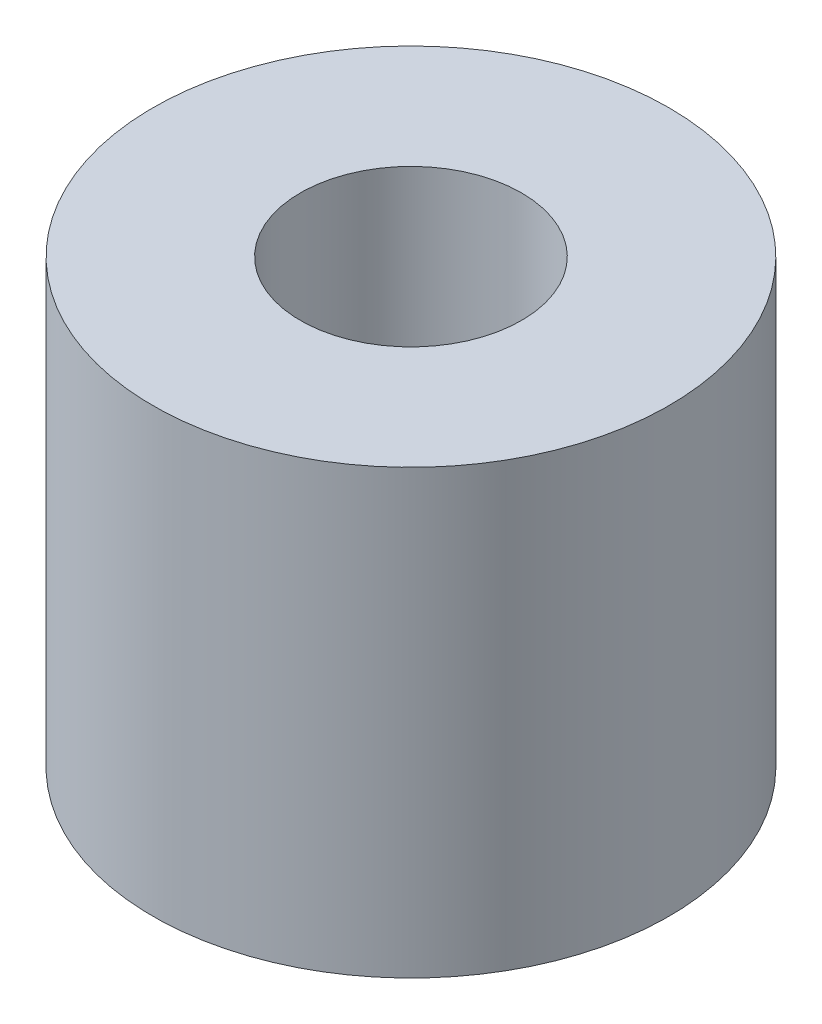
ISO-10303-21;
HEADER;
FILE_DESCRIPTION(('STEP AP214'),'2;1');
FILE_NAME('part.step','',(''),(''),'','','');
FILE_SCHEMA(('AUTOMOTIVE_DESIGN { 1 0 10303 214 1 1 1 1 }'));
ENDSEC;
DATA;
#1=APPLICATION_CONTEXT('core data for automotive mechanical design processes');
#2=APPLICATION_PROTOCOL_DEFINITION('international standard','automotive_design',2000,#1);
#3=PRODUCT_CONTEXT('',#1,'mechanical');
#4=PRODUCT('Part','Part','',(#3));
#5=PRODUCT_RELATED_PRODUCT_CATEGORY('part','',(#4));
#6=PRODUCT_DEFINITION_FORMATION('','',#4);
#7=PRODUCT_DEFINITION_CONTEXT('part definition',#1,'design');
#8=PRODUCT_DEFINITION('design','',#6,#7);
#9=PRODUCT_DEFINITION_SHAPE('','',#8);
#10=(LENGTH_UNIT() NAMED_UNIT(*) SI_UNIT(.MILLI.,.METRE.));
#11=(NAMED_UNIT(*) PLANE_ANGLE_UNIT() SI_UNIT($,.RADIAN.));
#12=(NAMED_UNIT(*) SI_UNIT($,.STERADIAN.) SOLID_ANGLE_UNIT());
#13=UNCERTAINTY_MEASURE_WITH_UNIT(LENGTH_MEASURE(1.E-05),#10,'distance_accuracy_value','');
#14=(GEOMETRIC_REPRESENTATION_CONTEXT(3) GLOBAL_UNCERTAINTY_ASSIGNED_CONTEXT((#13)) GLOBAL_UNIT_ASSIGNED_CONTEXT((#10,
#11,#12)) REPRESENTATION_CONTEXT('',''));
#15=CARTESIAN_POINT('',(0.,0.,0.));
#16=DIRECTION('',(0.,0.,1.));
#17=DIRECTION('',(1.,0.,0.));
#18=AXIS2_PLACEMENT_3D('',#15,#16,#17);
#19=CARTESIAN_POINT('',(0.,12.,0.));
#20=DIRECTION('',(0.,-1.,0.));
#21=DIRECTION('',(0.,0.,-1.));
#22=AXIS2_PLACEMENT_3D('',#19,#20,#21);
#23=CYLINDRICAL_SURFACE('',#22,3.);
#24=CARTESIAN_POINT('',(0.,0.,0.));
#25=DIRECTION('',(0.,-1.,0.));
#26=DIRECTION('',(0.,0.,-1.));
#27=AXIS2_PLACEMENT_3D('',#24,#25,#26);
#28=CIRCLE('',#27,3.);
#29=CARTESIAN_POINT('',(0.,0.,-3.));
#30=VERTEX_POINT('',#29);
#31=EDGE_CURVE('E27',#30,#30,#28,.T.);
#32=ORIENTED_EDGE('',*,*,#31,.T.);
#33=EDGE_LOOP('',(#32));
#34=FACE_BOUND('',#33,.T.);
#35=CARTESIAN_POINT('',(0.,12.,0.));
#36=DIRECTION('',(0.,-1.,0.));
#37=DIRECTION('',(0.,0.,-1.));
#38=AXIS2_PLACEMENT_3D('',#35,#36,#37);
#39=CIRCLE('',#38,3.);
#40=CARTESIAN_POINT('',(0.,12.,-3.));
#41=VERTEX_POINT('',#40);
#42=EDGE_CURVE('E18',#41,#41,#39,.T.);
#43=ORIENTED_EDGE('',*,*,#42,.F.);
#44=EDGE_LOOP('',(#43));
#45=FACE_BOUND('',#44,.T.);
#46=ADVANCED_FACE('F15',(#34,#45),#23,.F.);
#47=CARTESIAN_POINT('',(0.,12.,0.));
#48=DIRECTION('',(0.,1.,0.));
#49=DIRECTION('',(0.,0.,1.));
#50=AXIS2_PLACEMENT_3D('',#47,#48,#49);
#51=PLANE('',#50);
#52=ORIENTED_EDGE('',*,*,#42,.T.);
#53=EDGE_LOOP('',(#52));
#54=FACE_BOUND('',#53,.T.);
#55=CARTESIAN_POINT('',(0.,12.,0.));
#56=DIRECTION('',(0.,-1.,0.));
#57=DIRECTION('',(0.,0.,-1.));
#58=AXIS2_PLACEMENT_3D('',#55,#56,#57);
#59=CIRCLE('',#58,7.);
#60=CARTESIAN_POINT('',(0.,12.,-7.));
#61=VERTEX_POINT('',#60);
#62=EDGE_CURVE('E22',#61,#61,#59,.T.);
#63=ORIENTED_EDGE('',*,*,#62,.F.);
#64=EDGE_LOOP('',(#63));
#65=FACE_BOUND('',#64,.T.);
#66=ADVANCED_FACE('F35',(#54,#65),#51,.T.);
#67=CARTESIAN_POINT('',(0.,0.,0.));
#68=DIRECTION('',(0.,1.,0.));
#69=DIRECTION('',(0.,0.,1.));
#70=AXIS2_PLACEMENT_3D('',#67,#68,#69);
#71=PLANE('',#70);
#72=ORIENTED_EDGE('',*,*,#31,.F.);
#73=EDGE_LOOP('',(#72));
#74=FACE_BOUND('',#73,.T.);
#75=CARTESIAN_POINT('',(0.,0.,0.));
#76=DIRECTION('',(0.,-1.,0.));
#77=DIRECTION('',(0.,0.,-1.));
#78=AXIS2_PLACEMENT_3D('',#75,#76,#77);
#79=CIRCLE('',#78,7.);
#80=CARTESIAN_POINT('',(0.,0.,-7.));
#81=VERTEX_POINT('',#80);
#82=EDGE_CURVE('E10',#81,#81,#79,.F.);
#83=ORIENTED_EDGE('',*,*,#82,.F.);
#84=EDGE_LOOP('',(#83));
#85=FACE_BOUND('',#84,.T.);
#86=ADVANCED_FACE('F43',(#74,#85),#71,.F.);
#87=CARTESIAN_POINT('',(0.,12.,0.));
#88=DIRECTION('',(0.,-1.,0.));
#89=DIRECTION('',(0.,0.,-1.));
#90=AXIS2_PLACEMENT_3D('',#87,#88,#89);
#91=CYLINDRICAL_SURFACE('',#90,7.);
#92=ORIENTED_EDGE('',*,*,#82,.T.);
#93=EDGE_LOOP('',(#92));
#94=FACE_BOUND('',#93,.T.);
#95=ORIENTED_EDGE('',*,*,#62,.T.);
#96=EDGE_LOOP('',(#95));
#97=FACE_BOUND('',#96,.T.);
#98=ADVANCED_FACE('F44',(#94,#97),#91,.T.);
#99=CLOSED_SHELL('',(#46,#66,#86,#98));
#100=MANIFOLD_SOLID_BREP('B1',#99);
#101=ADVANCED_BREP_SHAPE_REPRESENTATION('',(#18,#100),#14);
#102=SHAPE_DEFINITION_REPRESENTATION(#9,#101);
ENDSEC;
END-ISO-10303-21;
